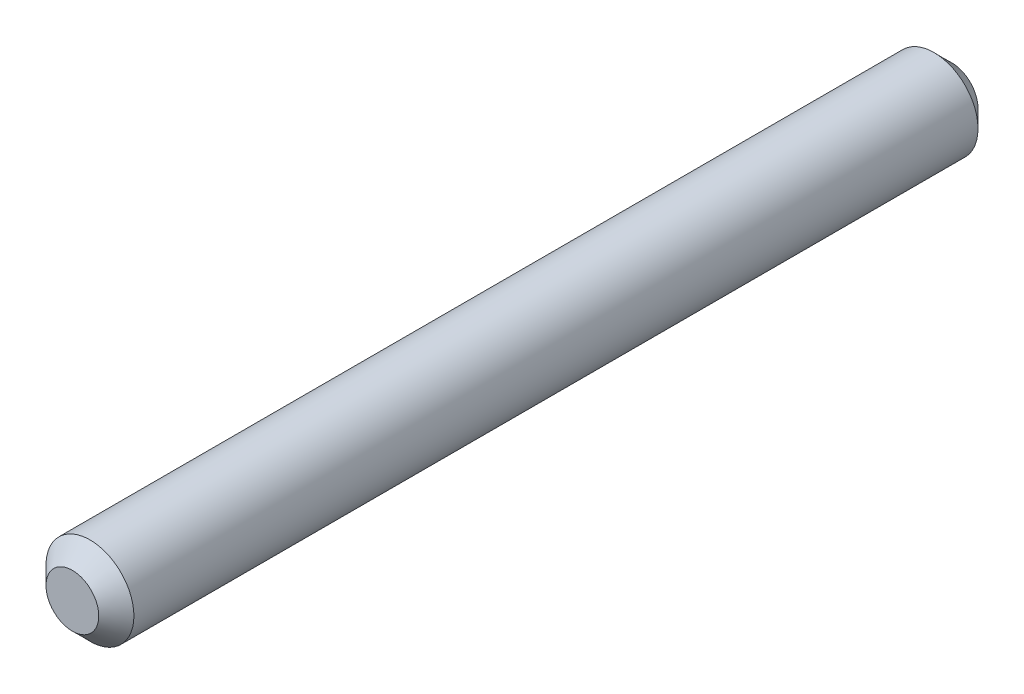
ISO-10303-21;
HEADER;
FILE_DESCRIPTION(('STEP AP214'),'2;1');
FILE_NAME('part.step','',(''),(''),'','','');
FILE_SCHEMA(('AUTOMOTIVE_DESIGN { 1 0 10303 214 1 1 1 1 }'));
ENDSEC;
DATA;
#1=APPLICATION_CONTEXT('core data for automotive mechanical design processes');
#2=APPLICATION_PROTOCOL_DEFINITION('international standard','automotive_design',2000,#1);
#3=PRODUCT_CONTEXT('',#1,'mechanical');
#4=PRODUCT('Part','Part','',(#3));
#5=PRODUCT_RELATED_PRODUCT_CATEGORY('part','',(#4));
#6=PRODUCT_DEFINITION_FORMATION('','',#4);
#7=PRODUCT_DEFINITION_CONTEXT('part definition',#1,'design');
#8=PRODUCT_DEFINITION('design','',#6,#7);
#9=PRODUCT_DEFINITION_SHAPE('','',#8);
#10=(LENGTH_UNIT() NAMED_UNIT(*) SI_UNIT(.MILLI.,.METRE.));
#11=(NAMED_UNIT(*) PLANE_ANGLE_UNIT() SI_UNIT($,.RADIAN.));
#12=(NAMED_UNIT(*) SI_UNIT($,.STERADIAN.) SOLID_ANGLE_UNIT());
#13=UNCERTAINTY_MEASURE_WITH_UNIT(LENGTH_MEASURE(1.E-05),#10,'distance_accuracy_value','');
#14=(GEOMETRIC_REPRESENTATION_CONTEXT(3) GLOBAL_UNCERTAINTY_ASSIGNED_CONTEXT((#13)) GLOBAL_UNIT_ASSIGNED_CONTEXT((#10,
#11,#12)) REPRESENTATION_CONTEXT('',''));
#15=CARTESIAN_POINT('',(0.,0.,0.));
#16=DIRECTION('',(0.,0.,1.));
#17=DIRECTION('',(1.,0.,0.));
#18=AXIS2_PLACEMENT_3D('',#15,#16,#17);
#19=CARTESIAN_POINT('',(0.,0.,25.));
#20=DIRECTION('',(0.,0.,-1.));
#21=DIRECTION('',(-1.,0.,0.));
#22=AXIS2_PLACEMENT_3D('',#19,#20,#21);
#23=CYLINDRICAL_SURFACE('',#22,1.25);
#24=CARTESIAN_POINT('',(0.,0.,24.5));
#25=DIRECTION('',(0.,0.,1.));
#26=DIRECTION('',(1.,0.,0.));
#27=AXIS2_PLACEMENT_3D('',#24,#25,#26);
#28=CIRCLE('',#27,1.25);
#29=CARTESIAN_POINT('',(1.25,0.,24.5));
#30=VERTEX_POINT('',#29);
#31=EDGE_CURVE('E35',#30,#30,#28,.F.);
#32=ORIENTED_EDGE('',*,*,#31,.T.);
#33=EDGE_LOOP('',(#32));
#34=FACE_BOUND('',#33,.T.);
#35=CARTESIAN_POINT('',(0.,0.,0.500000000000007));
#36=DIRECTION('',(0.,0.,1.));
#37=DIRECTION('',(1.,0.,0.));
#38=AXIS2_PLACEMENT_3D('',#35,#36,#37);
#39=CIRCLE('',#38,1.25);
#40=CARTESIAN_POINT('',(1.25,0.,0.500000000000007));
#41=VERTEX_POINT('',#40);
#42=EDGE_CURVE('E39',#41,#41,#39,.T.);
#43=ORIENTED_EDGE('',*,*,#42,.T.);
#44=EDGE_LOOP('',(#43));
#45=FACE_BOUND('',#44,.T.);
#46=ADVANCED_FACE('F29',(#34,#45),#23,.T.);
#47=CARTESIAN_POINT('',(0.,0.,25.));
#48=DIRECTION('',(0.,0.,1.));
#49=DIRECTION('',(1.,0.,0.));
#50=AXIS2_PLACEMENT_3D('',#47,#48,#49);
#51=PLANE('',#50);
#52=CARTESIAN_POINT('',(0.,0.,25.));
#53=DIRECTION('',(0.,0.,1.));
#54=DIRECTION('',(1.,0.,0.));
#55=AXIS2_PLACEMENT_3D('',#52,#53,#54);
#56=CIRCLE('',#55,0.749999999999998);
#57=CARTESIAN_POINT('',(0.749999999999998,0.,25.));
#58=VERTEX_POINT('',#57);
#59=EDGE_CURVE('E43',#58,#58,#56,.T.);
#60=ORIENTED_EDGE('',*,*,#59,.T.);
#61=EDGE_LOOP('',(#60));
#62=FACE_BOUND('',#61,.T.);
#63=ADVANCED_FACE('F49',(#62),#51,.T.);
#64=CARTESIAN_POINT('',(0.,0.,0.));
#65=DIRECTION('',(0.,0.,1.));
#66=DIRECTION('',(1.,0.,0.));
#67=AXIS2_PLACEMENT_3D('',#64,#65,#66);
#68=PLANE('',#67);
#69=CARTESIAN_POINT('',(0.,0.,0.));
#70=DIRECTION('',(0.,0.,1.));
#71=DIRECTION('',(1.,0.,0.));
#72=AXIS2_PLACEMENT_3D('',#69,#70,#71);
#73=CIRCLE('',#72,0.749999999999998);
#74=CARTESIAN_POINT('',(0.749999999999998,0.,0.));
#75=VERTEX_POINT('',#74);
#76=EDGE_CURVE('E10',#75,#75,#73,.F.);
#77=ORIENTED_EDGE('',*,*,#76,.T.);
#78=EDGE_LOOP('',(#77));
#79=FACE_BOUND('',#78,.T.);
#80=ADVANCED_FACE('F54',(#79),#68,.F.);
#81=CARTESIAN_POINT('',(0.,0.,25.));
#82=DIRECTION('',(0.,0.,-1.));
#83=DIRECTION('',(-1.,0.,0.));
#84=AXIS2_PLACEMENT_3D('',#81,#82,#83);
#85=CONICAL_SURFACE('',#84,0.749999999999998,0.785398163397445);
#86=ORIENTED_EDGE('',*,*,#31,.F.);
#87=EDGE_LOOP('',(#86));
#88=FACE_BOUND('',#87,.T.);
#89=ORIENTED_EDGE('',*,*,#59,.F.);
#90=EDGE_LOOP('',(#89));
#91=FACE_BOUND('',#90,.T.);
#92=ADVANCED_FACE('F51',(#88,#91),#85,.T.);
#93=CARTESIAN_POINT('',(0.,0.,0.500000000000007));
#94=DIRECTION('',(0.,0.,1.));
#95=DIRECTION('',(1.,0.,0.));
#96=AXIS2_PLACEMENT_3D('',#93,#94,#95);
#97=CONICAL_SURFACE('',#96,1.25,0.785398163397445);
#98=ORIENTED_EDGE('',*,*,#76,.F.);
#99=EDGE_LOOP('',(#98));
#100=FACE_BOUND('',#99,.T.);
#101=ORIENTED_EDGE('',*,*,#42,.F.);
#102=EDGE_LOOP('',(#101));
#103=FACE_BOUND('',#102,.T.);
#104=ADVANCED_FACE('F53',(#100,#103),#97,.T.);
#105=CLOSED_SHELL('',(#46,#63,#80,#92,#104));
#106=MANIFOLD_SOLID_BREP('B2',#105);
#107=ADVANCED_BREP_SHAPE_REPRESENTATION('',(#18,#106),#14);
#108=SHAPE_DEFINITION_REPRESENTATION(#9,#107);
ENDSEC;
END-ISO-10303-21;
